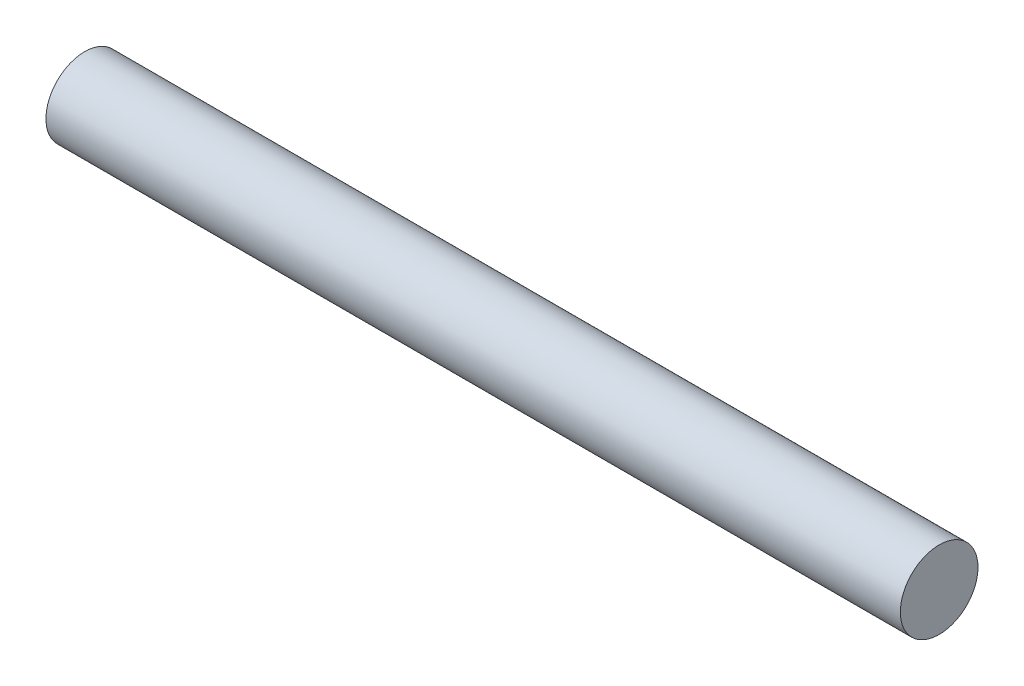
from build123d import *

# Parameters (mm, degrees)
CROQUIS1_R              = 10
SALIENTE_EXTRUIR1_DEPTH = 220


with BuildPart() as part:
    # Croquis1 → Saliente-Extruir1 (new body)
    with BuildSketch(Plane(origin=(0, 0, 0), x_dir=(0, 0, -1), z_dir=(1, 0, 0))):
        Circle(CROQUIS1_R)
    extrude(amount=SALIENTE_EXTRUIR1_DEPTH)


solid = part.part
